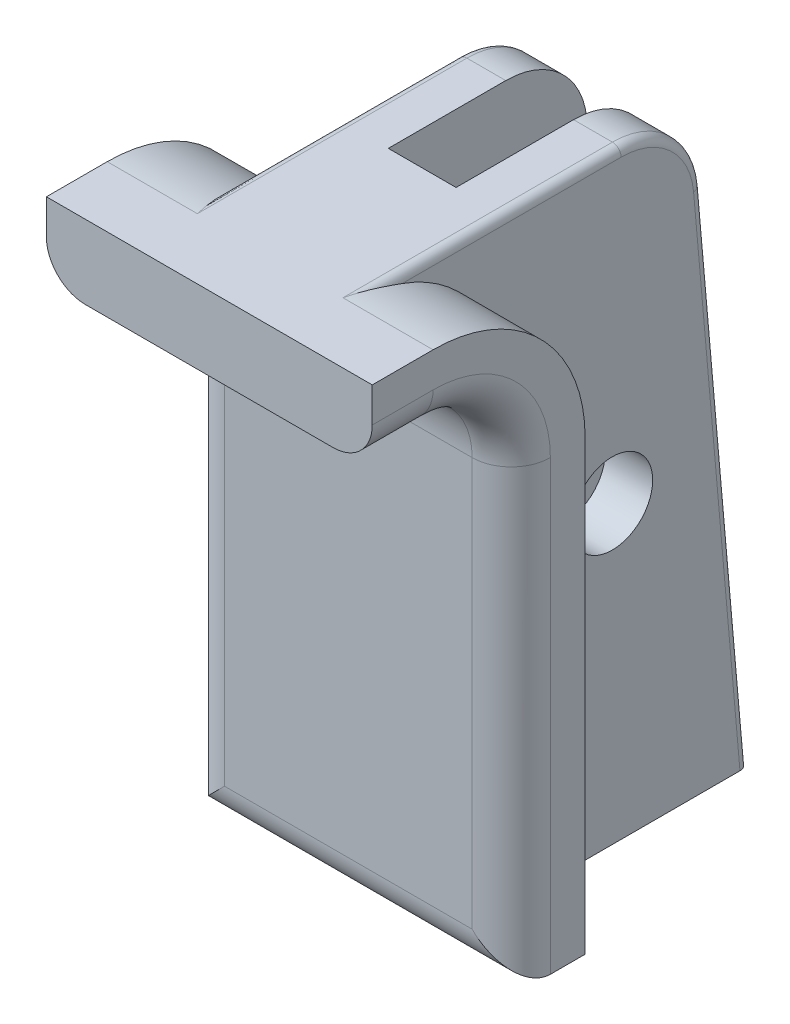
ISO-10303-21;
HEADER;
FILE_DESCRIPTION(('STEP AP214'),'2;1');
FILE_NAME('part.step','',(''),(''),'','','');
FILE_SCHEMA(('AUTOMOTIVE_DESIGN { 1 0 10303 214 1 1 1 1 }'));
ENDSEC;
DATA;
#1=APPLICATION_CONTEXT('core data for automotive mechanical design processes');
#2=APPLICATION_PROTOCOL_DEFINITION('international standard','automotive_design',2000,#1);
#3=PRODUCT_CONTEXT('',#1,'mechanical');
#4=PRODUCT('Part','Part','',(#3));
#5=PRODUCT_RELATED_PRODUCT_CATEGORY('part','',(#4));
#6=PRODUCT_DEFINITION_FORMATION('','',#4);
#7=PRODUCT_DEFINITION_CONTEXT('part definition',#1,'design');
#8=PRODUCT_DEFINITION('design','',#6,#7);
#9=PRODUCT_DEFINITION_SHAPE('','',#8);
#10=(LENGTH_UNIT() NAMED_UNIT(*) SI_UNIT(.MILLI.,.METRE.));
#11=(NAMED_UNIT(*) PLANE_ANGLE_UNIT() SI_UNIT($,.RADIAN.));
#12=(NAMED_UNIT(*) SI_UNIT($,.STERADIAN.) SOLID_ANGLE_UNIT());
#13=UNCERTAINTY_MEASURE_WITH_UNIT(LENGTH_MEASURE(1.E-05),#10,'distance_accuracy_value','');
#14=(GEOMETRIC_REPRESENTATION_CONTEXT(3) GLOBAL_UNCERTAINTY_ASSIGNED_CONTEXT((#13)) GLOBAL_UNIT_ASSIGNED_CONTEXT((#10,
#11,#12)) REPRESENTATION_CONTEXT('',''));
#15=CARTESIAN_POINT('',(0.,0.,0.));
#16=DIRECTION('',(0.,0.,1.));
#17=DIRECTION('',(1.,0.,0.));
#18=AXIS2_PLACEMENT_3D('',#15,#16,#17);
#19=CARTESIAN_POINT('',(2.38125,15.3544484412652,-5.80537774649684));
#20=DIRECTION('',(0.,-0.0880623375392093,0.99611496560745));
#21=DIRECTION('',(0.,-0.99611496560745,-0.0880623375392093));
#22=AXIS2_PLACEMENT_3D('',#19,#20,#21);
#23=PLANE('',#22);
#24=DIRECTION('',(-1.,0.,0.));
#25=VECTOR('',#24,1.);
#26=CARTESIAN_POINT('',(2.38125,15.3544484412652,-5.80537774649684));
#27=LINE('',#26,#25);
#28=CARTESIAN_POINT('',(-0.9906,15.3544484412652,-5.80537774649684));
#29=VERTEX_POINT('',#28);
#30=CARTESIAN_POINT('',(-2.12725,15.3544484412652,-5.80537774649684));
#31=VERTEX_POINT('',#30);
#32=EDGE_CURVE('E318',#29,#31,#27,.T.);
#33=ORIENTED_EDGE('',*,*,#32,.F.);
#34=DIRECTION('',(0.,-0.99611496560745,-0.0880623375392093));
#35=VECTOR('',#34,1.);
#36=CARTESIAN_POINT('',(-0.9906,15.3544484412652,-5.80537774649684));
#37=LINE('',#36,#35);
#38=CARTESIAN_POINT('',(-0.990600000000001,0.,-7.1628));
#39=VERTEX_POINT('',#38);
#40=EDGE_CURVE('E249',#29,#39,#37,.T.);
#41=ORIENTED_EDGE('',*,*,#40,.T.);
#42=DIRECTION('',(-1.,0.,0.));
#43=VECTOR('',#42,1.);
#44=CARTESIAN_POINT('',(2.38125,0.,-7.1628));
#45=LINE('',#44,#43);
#46=CARTESIAN_POINT('',(-2.12725,0.,-7.1628));
#47=VERTEX_POINT('',#46);
#48=EDGE_CURVE('E322',#39,#47,#45,.T.);
#49=ORIENTED_EDGE('',*,*,#48,.T.);
#50=DIRECTION('',(0.,0.99611496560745,0.0880623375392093));
#51=VECTOR('',#50,1.);
#52=CARTESIAN_POINT('',(-2.12725,15.3544484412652,-5.80537774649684));
#53=LINE('',#52,#51);
#54=EDGE_CURVE('E378',#47,#31,#53,.T.);
#55=ORIENTED_EDGE('',*,*,#54,.T.);
#56=EDGE_LOOP('',(#33,#41,#49,#55));
#57=FACE_BOUND('',#56,.T.);
#58=ADVANCED_FACE('F33',(#57),#23,.F.);
#59=CARTESIAN_POINT('',(2.38125,15.14475,-3.4333789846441));
#60=DIRECTION('',(-1.,0.,0.));
#61=DIRECTION('',(0.,0.,1.));
#62=AXIS2_PLACEMENT_3D('',#59,#60,#61);
#63=CYLINDRICAL_SURFACE('',#62,2.38125);
#64=DIRECTION('',(-1.,0.,0.));
#65=VECTOR('',#64,1.);
#66=CARTESIAN_POINT('',(2.38125,17.526,-3.4333789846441));
#67=LINE('',#66,#65);
#68=CARTESIAN_POINT('',(-0.9906,17.526,-3.4333789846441));
#69=VERTEX_POINT('',#68);
#70=CARTESIAN_POINT('',(-2.12725,17.526,-3.4333789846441));
#71=VERTEX_POINT('',#70);
#72=EDGE_CURVE('E310',#69,#71,#67,.T.);
#73=ORIENTED_EDGE('',*,*,#72,.F.);
#74=CARTESIAN_POINT('',(-0.9906,15.14475,-3.4333789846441));
#75=DIRECTION('',(-1.,0.,0.));
#76=DIRECTION('',(0.,0.,1.));
#77=AXIS2_PLACEMENT_3D('',#74,#75,#76);
#78=CIRCLE('',#77,2.38125);
#79=EDGE_CURVE('E227',#69,#29,#78,.T.);
#80=ORIENTED_EDGE('',*,*,#79,.T.);
#81=ORIENTED_EDGE('',*,*,#32,.T.);
#82=CARTESIAN_POINT('',(-2.12725,15.14475,-3.4333789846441));
#83=DIRECTION('',(1.,0.,0.));
#84=DIRECTION('',(0.,0.,-1.));
#85=AXIS2_PLACEMENT_3D('',#82,#83,#84);
#86=CIRCLE('',#85,2.38125);
#87=EDGE_CURVE('E394',#31,#71,#86,.T.);
#88=ORIENTED_EDGE('',*,*,#87,.T.);
#89=EDGE_LOOP('',(#73,#80,#81,#88));
#90=FACE_BOUND('',#89,.T.);
#91=ADVANCED_FACE('F453',(#90),#63,.T.);
#92=CARTESIAN_POINT('',(4.7625,13.081,4.445));
#93=DIRECTION('',(-1.,0.,0.));
#94=DIRECTION('',(0.,0.,1.));
#95=AXIS2_PLACEMENT_3D('',#92,#93,#94);
#96=CYLINDRICAL_SURFACE('',#95,4.445);
#97=CARTESIAN_POINT('',(-2.38125,13.081,4.445));
#98=DIRECTION('',(1.,0.,0.));
#99=DIRECTION('',(0.,0.,-1.));
#100=AXIS2_PLACEMENT_3D('',#97,#98,#99);
#101=CIRCLE('',#100,4.445);
#102=CARTESIAN_POINT('',(-2.38125,13.081,0.));
#103=VERTEX_POINT('',#102);
#104=CARTESIAN_POINT('',(-2.38125,17.272,2.96393821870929));
#105=VERTEX_POINT('',#104);
#106=EDGE_CURVE('E253',#103,#105,#101,.T.);
#107=ORIENTED_EDGE('',*,*,#106,.F.);
#108=DIRECTION('',(-1.,0.,0.));
#109=VECTOR('',#108,1.);
#110=CARTESIAN_POINT('',(4.7625,13.081,0.));
#111=LINE('',#110,#109);
#112=CARTESIAN_POINT('',(-4.7625,13.081,0.));
#113=VERTEX_POINT('',#112);
#114=EDGE_CURVE('E296',#103,#113,#111,.T.);
#115=ORIENTED_EDGE('',*,*,#114,.T.);
#116=CARTESIAN_POINT('',(-4.7625,13.081,4.445));
#117=DIRECTION('',(1.,0.,0.));
#118=DIRECTION('',(0.,0.,-1.));
#119=AXIS2_PLACEMENT_3D('',#116,#117,#118);
#120=CIRCLE('',#119,4.445);
#121=CARTESIAN_POINT('',(-4.7625,17.526,4.44500000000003));
#122=VERTEX_POINT('',#121);
#123=EDGE_CURVE('E277',#113,#122,#120,.T.);
#124=ORIENTED_EDGE('',*,*,#123,.T.);
#125=DIRECTION('',(-1.,0.,0.));
#126=VECTOR('',#125,1.);
#127=CARTESIAN_POINT('',(4.7625,17.526,4.44500000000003));
#128=LINE('',#127,#126);
#129=CARTESIAN_POINT('',(-2.12725,17.526,4.44500000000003));
#130=VERTEX_POINT('',#129);
#131=EDGE_CURVE('E58',#130,#122,#128,.T.);
#132=ORIENTED_EDGE('',*,*,#131,.F.);
#133=CARTESIAN_POINT('',(-2.38125,17.272,2.96393821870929));
#134=CARTESIAN_POINT('',(-2.38122661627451,17.2862236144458,3.00418337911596));
#135=CARTESIAN_POINT('',(-2.38005740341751,17.2998582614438,3.04461457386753));
#136=CARTESIAN_POINT('',(-2.37581660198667,17.3259225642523,3.12573211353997));
#137=CARTESIAN_POINT('',(-2.37274652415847,17.3383531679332,3.16641823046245));
#138=CARTESIAN_POINT('',(-2.36509781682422,17.3619870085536,3.24793093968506));
#139=CARTESIAN_POINT('',(-2.36052148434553,17.3731920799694,3.28875722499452));
#140=CARTESIAN_POINT('',(-2.35012615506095,17.3943998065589,3.3705728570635));
#141=CARTESIAN_POINT('',(-2.34430679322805,17.4044021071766,3.4115622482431));
#142=CARTESIAN_POINT('',(-2.32548742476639,17.4323736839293,3.53368855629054));
#143=CARTESIAN_POINT('',(-2.31101814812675,17.448602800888,3.61500541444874));
#144=CARTESIAN_POINT('',(-2.27944917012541,17.4764352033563,3.7779091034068));
#145=CARTESIAN_POINT('',(-2.26234854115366,17.4880368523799,3.85949601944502));
#146=CARTESIAN_POINT('',(-2.20858763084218,17.5159938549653,4.10457360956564));
#147=CARTESIAN_POINT('',(-2.16946634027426,17.5255037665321,4.26839214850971));
#148=CARTESIAN_POINT('',(-2.12931669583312,17.5259936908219,4.43635426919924));
#149=CARTESIAN_POINT('',(-2.12828331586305,17.5259999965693,4.44067720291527));
#150=CARTESIAN_POINT('',(-2.12725,17.526,4.445));
#151=B_SPLINE_CURVE_WITH_KNOTS('',3,(#133,#134,#135,#136,#137,#138,#139,#140,#141,#142,#143,
#144,#145,#146,#147,#148,#149,#150),.UNSPECIFIED.,.F.,.F.,(4,2,2,2,2,2,2,2,4),(0.,
0.128005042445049,0.255908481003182,0.383617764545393,0.511364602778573,0.763659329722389,
1.01604320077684,1.52077670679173,1.53411088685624),.UNSPECIFIED.);
#152=EDGE_CURVE('E408',#130,#105,#151,.F.);
#153=ORIENTED_EDGE('',*,*,#152,.T.);
#154=EDGE_LOOP('',(#107,#115,#124,#132,#153));
#155=FACE_BOUND('',#154,.T.);
#156=ADVANCED_FACE('F431',(#155),#96,.T.);
#157=CARTESIAN_POINT('',(2.38125,0.,0.));
#158=DIRECTION('',(0.,1.,0.));
#159=DIRECTION('',(0.,0.,1.));
#160=AXIS2_PLACEMENT_3D('',#157,#158,#159);
#161=PLANE('',#160);
#162=ORIENTED_EDGE('',*,*,#48,.F.);
#163=DIRECTION('',(0.,0.,-1.));
#164=VECTOR('',#163,1.);
#165=CARTESIAN_POINT('',(-0.990600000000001,0.,-10.4447005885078));
#166=LINE('',#165,#164);
#167=CARTESIAN_POINT('',(-0.990599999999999,0.,0.));
#168=VERTEX_POINT('',#167);
#169=EDGE_CURVE('E237',#168,#39,#166,.T.);
#170=ORIENTED_EDGE('',*,*,#169,.F.);
#171=DIRECTION('',(-1.,0.,0.));
#172=VECTOR('',#171,1.);
#173=CARTESIAN_POINT('',(0.9906,0.,0.));
#174=LINE('',#173,#172);
#175=CARTESIAN_POINT('',(0.9906,0.,0.));
#176=VERTEX_POINT('',#175);
#177=EDGE_CURVE('E217',#176,#168,#174,.T.);
#178=ORIENTED_EDGE('',*,*,#177,.F.);
#179=DIRECTION('',(0.,0.,1.));
#180=VECTOR('',#179,1.);
#181=CARTESIAN_POINT('',(0.990599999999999,0.,-10.4447005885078));
#182=LINE('',#181,#180);
#183=CARTESIAN_POINT('',(0.990599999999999,0.,-7.1628));
#184=VERTEX_POINT('',#183);
#185=EDGE_CURVE('E239',#184,#176,#182,.T.);
#186=ORIENTED_EDGE('',*,*,#185,.F.);
#187=CARTESIAN_POINT('',(2.12725,0.,-7.1628));
#188=VERTEX_POINT('',#187);
#189=EDGE_CURVE('E323',#188,#184,#45,.T.);
#190=ORIENTED_EDGE('',*,*,#189,.F.);
#191=CARTESIAN_POINT('',(2.12725,0.,-6.90780935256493));
#192=DIRECTION('',(0.,1.,0.));
#193=DIRECTION('',(0.,0.,-1.));
#194=AXIS2_PLACEMENT_3D('',#191,#192,#193);
#195=ELLIPSE('',#194,0.254990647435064,0.254);
#196=CARTESIAN_POINT('',(2.38125,0.,-6.90780935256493));
#197=VERTEX_POINT('',#196);
#198=EDGE_CURVE('E387',#188,#197,#195,.F.);
#199=ORIENTED_EDGE('',*,*,#198,.T.);
#200=DIRECTION('',(0.,0.,-1.));
#201=VECTOR('',#200,1.);
#202=CARTESIAN_POINT('',(2.38125,0.,0.));
#203=LINE('',#202,#201);
#204=CARTESIAN_POINT('',(2.38125,0.,0.));
#205=VERTEX_POINT('',#204);
#206=EDGE_CURVE('E307',#205,#197,#203,.T.);
#207=ORIENTED_EDGE('',*,*,#206,.F.);
#208=DIRECTION('',(-1.,0.,0.));
#209=VECTOR('',#208,1.);
#210=CARTESIAN_POINT('',(4.7625,0.,0.));
#211=LINE('',#210,#209);
#212=CARTESIAN_POINT('',(4.7625,0.,0.));
#213=VERTEX_POINT('',#212);
#214=EDGE_CURVE('E301',#213,#205,#211,.T.);
#215=ORIENTED_EDGE('',*,*,#214,.F.);
#216=DIRECTION('',(0.,0.,-1.));
#217=VECTOR('',#216,1.);
#218=CARTESIAN_POINT('',(4.7625,0.,2.159));
#219=LINE('',#218,#217);
#220=CARTESIAN_POINT('',(4.7625,0.,1.016));
#221=VERTEX_POINT('',#220);
#222=EDGE_CURVE('E260',#221,#213,#219,.T.);
#223=ORIENTED_EDGE('',*,*,#222,.F.);
#224=DIRECTION('',(-1.,0.,0.));
#225=VECTOR('',#224,1.);
#226=CARTESIAN_POINT('',(2.38125,0.,1.016));
#227=LINE('',#226,#225);
#228=CARTESIAN_POINT('',(-4.7625,0.,1.016));
#229=VERTEX_POINT('',#228);
#230=EDGE_CURVE('E357',#221,#229,#227,.T.);
#231=ORIENTED_EDGE('',*,*,#230,.T.);
#232=DIRECTION('',(0.,0.,-1.));
#233=VECTOR('',#232,1.);
#234=CARTESIAN_POINT('',(-4.7625,0.,2.159));
#235=LINE('',#234,#233);
#236=CARTESIAN_POINT('',(-4.7625,0.,0.));
#237=VERTEX_POINT('',#236);
#238=EDGE_CURVE('E259',#229,#237,#235,.T.);
#239=ORIENTED_EDGE('',*,*,#238,.T.);
#240=CARTESIAN_POINT('',(-2.38125,0.,0.));
#241=VERTEX_POINT('',#240);
#242=EDGE_CURVE('E300',#241,#237,#211,.T.);
#243=ORIENTED_EDGE('',*,*,#242,.F.);
#244=DIRECTION('',(0.,0.,-1.));
#245=VECTOR('',#244,1.);
#246=CARTESIAN_POINT('',(-2.38125,0.,0.));
#247=LINE('',#246,#245);
#248=CARTESIAN_POINT('',(-2.38125,0.,-6.90780935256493));
#249=VERTEX_POINT('',#248);
#250=EDGE_CURVE('E306',#241,#249,#247,.T.);
#251=ORIENTED_EDGE('',*,*,#250,.T.);
#252=CARTESIAN_POINT('',(-2.12725,0.,-6.90780935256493));
#253=DIRECTION('',(0.,1.,0.));
#254=DIRECTION('',(0.,0.,1.));
#255=AXIS2_PLACEMENT_3D('',#252,#253,#254);
#256=ELLIPSE('',#255,0.254990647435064,0.254);
#257=EDGE_CURVE('E389',#249,#47,#256,.F.);
#258=ORIENTED_EDGE('',*,*,#257,.T.);
#259=EDGE_LOOP('',(#162,#170,#178,#186,#190,#199,#207,#215,#223,#231,#239,#243,#251,#258));
#260=FACE_BOUND('',#259,.T.);
#261=ADVANCED_FACE('F456',(#260),#161,.F.);
#262=ORIENTED_EDGE('',*,*,#189,.T.);
#263=DIRECTION('',(0.,0.99611496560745,0.0880623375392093));
#264=VECTOR('',#263,1.);
#265=CARTESIAN_POINT('',(0.990599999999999,15.3544484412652,-5.80537774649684));
#266=LINE('',#265,#264);
#267=CARTESIAN_POINT('',(0.990599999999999,15.3544484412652,-5.80537774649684));
#268=VERTEX_POINT('',#267);
#269=EDGE_CURVE('E245',#184,#268,#266,.T.);
#270=ORIENTED_EDGE('',*,*,#269,.T.);
#271=CARTESIAN_POINT('',(2.12725,15.3544484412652,-5.80537774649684));
#272=VERTEX_POINT('',#271);
#273=EDGE_CURVE('E319',#272,#268,#27,.T.);
#274=ORIENTED_EDGE('',*,*,#273,.F.);
#275=DIRECTION('',(0.,0.99611496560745,0.0880623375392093));
#276=VECTOR('',#275,1.);
#277=CARTESIAN_POINT('',(2.12725,0.,-7.1628));
#278=LINE('',#277,#276);
#279=EDGE_CURVE('E359',#272,#188,#278,.F.);
#280=ORIENTED_EDGE('',*,*,#279,.T.);
#281=EDGE_LOOP('',(#262,#270,#274,#280));
#282=FACE_BOUND('',#281,.T.);
#283=ADVANCED_FACE('F451',(#282),#23,.F.);
#284=ORIENTED_EDGE('',*,*,#273,.T.);
#285=CARTESIAN_POINT('',(0.9906,15.14475,-3.4333789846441));
#286=DIRECTION('',(1.,0.,0.));
#287=DIRECTION('',(0.,0.,-1.));
#288=AXIS2_PLACEMENT_3D('',#285,#286,#287);
#289=CIRCLE('',#288,2.38125);
#290=CARTESIAN_POINT('',(0.9906,17.526,-3.4333789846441));
#291=VERTEX_POINT('',#290);
#292=EDGE_CURVE('E220',#268,#291,#289,.T.);
#293=ORIENTED_EDGE('',*,*,#292,.T.);
#294=CARTESIAN_POINT('',(2.12725,17.526,-3.4333789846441));
#295=VERTEX_POINT('',#294);
#296=EDGE_CURVE('E316',#295,#291,#67,.T.);
#297=ORIENTED_EDGE('',*,*,#296,.F.);
#298=CARTESIAN_POINT('',(2.12725,15.14475,-3.4333789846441));
#299=DIRECTION('',(1.,0.,0.));
#300=DIRECTION('',(0.,0.,-1.));
#301=AXIS2_PLACEMENT_3D('',#298,#299,#300);
#302=CIRCLE('',#301,2.38125);
#303=EDGE_CURVE('E392',#295,#272,#302,.F.);
#304=ORIENTED_EDGE('',*,*,#303,.T.);
#305=EDGE_LOOP('',(#284,#293,#297,#304));
#306=FACE_BOUND('',#305,.T.);
#307=ADVANCED_FACE('F448',(#306),#63,.T.);
#308=CARTESIAN_POINT('',(2.38125,17.526,-3.4333789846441));
#309=DIRECTION('',(0.,-1.,0.));
#310=DIRECTION('',(0.,0.,-1.));
#311=AXIS2_PLACEMENT_3D('',#308,#309,#310);
#312=PLANE('',#311);
#313=DIRECTION('',(-1.,0.,0.));
#314=VECTOR('',#313,1.);
#315=CARTESIAN_POINT('',(0.9906,17.526,0.));
#316=LINE('',#315,#314);
#317=CARTESIAN_POINT('',(0.9906,17.526,0.));
#318=VERTEX_POINT('',#317);
#319=CARTESIAN_POINT('',(-0.990599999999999,17.526,0.));
#320=VERTEX_POINT('',#319);
#321=EDGE_CURVE('E50',#318,#320,#316,.T.);
#322=ORIENTED_EDGE('',*,*,#321,.T.);
#323=DIRECTION('',(0.,0.,-1.));
#324=VECTOR('',#323,1.);
#325=CARTESIAN_POINT('',(-0.990600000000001,17.526,-10.4447005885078));
#326=LINE('',#325,#324);
#327=EDGE_CURVE('E224',#320,#69,#326,.T.);
#328=ORIENTED_EDGE('',*,*,#327,.T.);
#329=ORIENTED_EDGE('',*,*,#72,.T.);
#330=DIRECTION('',(0.,0.,1.));
#331=VECTOR('',#330,1.);
#332=CARTESIAN_POINT('',(-2.12725,17.526,-3.4333789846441));
#333=LINE('',#332,#331);
#334=EDGE_CURVE('E406',#71,#130,#333,.T.);
#335=ORIENTED_EDGE('',*,*,#334,.T.);
#336=ORIENTED_EDGE('',*,*,#131,.T.);
#337=DIRECTION('',(0.,0.,1.));
#338=VECTOR('',#337,1.);
#339=CARTESIAN_POINT('',(-4.7625,17.526,4.44500000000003));
#340=LINE('',#339,#338);
#341=CARTESIAN_POINT('',(-4.7625,17.526,6.223));
#342=VERTEX_POINT('',#341);
#343=EDGE_CURVE('E279',#122,#342,#340,.T.);
#344=ORIENTED_EDGE('',*,*,#343,.T.);
#345=DIRECTION('',(-1.,0.,0.));
#346=VECTOR('',#345,1.);
#347=CARTESIAN_POINT('',(4.7625,17.526,6.223));
#348=LINE('',#347,#346);
#349=CARTESIAN_POINT('',(4.7625,17.526,6.223));
#350=VERTEX_POINT('',#349);
#351=EDGE_CURVE('E291',#350,#342,#348,.T.);
#352=ORIENTED_EDGE('',*,*,#351,.F.);
#353=DIRECTION('',(0.,0.,1.));
#354=VECTOR('',#353,1.);
#355=CARTESIAN_POINT('',(4.7625,17.526,4.44500000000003));
#356=LINE('',#355,#354);
#357=CARTESIAN_POINT('',(4.7625,17.526,4.44500000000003));
#358=VERTEX_POINT('',#357);
#359=EDGE_CURVE('E267',#358,#350,#356,.T.);
#360=ORIENTED_EDGE('',*,*,#359,.F.);
#361=CARTESIAN_POINT('',(2.12725,17.526,4.44500000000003));
#362=VERTEX_POINT('',#361);
#363=EDGE_CURVE('E294',#358,#362,#128,.T.);
#364=ORIENTED_EDGE('',*,*,#363,.T.);
#365=DIRECTION('',(0.,0.,1.));
#366=VECTOR('',#365,1.);
#367=CARTESIAN_POINT('',(2.12725,17.526,-3.4333789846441));
#368=LINE('',#367,#366);
#369=EDGE_CURVE('E404',#362,#295,#368,.F.);
#370=ORIENTED_EDGE('',*,*,#369,.T.);
#371=ORIENTED_EDGE('',*,*,#296,.T.);
#372=DIRECTION('',(0.,0.,1.));
#373=VECTOR('',#372,1.);
#374=CARTESIAN_POINT('',(0.9906,17.526,-3.4333789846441));
#375=LINE('',#374,#373);
#376=EDGE_CURVE('E11',#291,#318,#375,.T.);
#377=ORIENTED_EDGE('',*,*,#376,.T.);
#378=EDGE_LOOP('',(#322,#328,#329,#335,#336,#344,#352,#360,#364,#370,#371,#377));
#379=FACE_BOUND('',#378,.T.);
#380=ADVANCED_FACE('F231',(#379),#312,.F.);
#381=CARTESIAN_POINT('',(2.38125,15.14475,-3.4333789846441));
#382=DIRECTION('',(1.,0.,0.));
#383=DIRECTION('',(0.,0.,-1.));
#384=AXIS2_PLACEMENT_3D('',#381,#382,#383);
#385=PLANE('',#384);
#386=CARTESIAN_POINT('',(2.38125,8.636,-3.175));
#387=DIRECTION('',(1.,0.,0.));
#388=DIRECTION('',(0.,0.,-1.));
#389=AXIS2_PLACEMENT_3D('',#386,#387,#388);
#390=CIRCLE('',#389,1.1811);
#391=CARTESIAN_POINT('',(2.38125,8.636,-4.3561));
#392=VERTEX_POINT('',#391);
#393=EDGE_CURVE('E837',#392,#392,#390,.T.);
#394=ORIENTED_EDGE('',*,*,#393,.F.);
#395=EDGE_LOOP('',(#394));
#396=FACE_BOUND('',#395,.T.);
#397=ORIENTED_EDGE('',*,*,#206,.T.);
#398=DIRECTION('',(0.,0.99611496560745,0.0880623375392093));
#399=VECTOR('',#398,1.);
#400=CARTESIAN_POINT('',(2.38125,15.3320806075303,-5.55236454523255));
#401=LINE('',#400,#399);
#402=CARTESIAN_POINT('',(2.38125,15.3320806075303,-5.55236454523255));
#403=VERTEX_POINT('',#402);
#404=EDGE_CURVE('E401',#197,#403,#401,.T.);
#405=ORIENTED_EDGE('',*,*,#404,.T.);
#406=CARTESIAN_POINT('',(2.38125,15.14475,-3.4333789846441));
#407=DIRECTION('',(1.,0.,0.));
#408=DIRECTION('',(0.,0.,-1.));
#409=AXIS2_PLACEMENT_3D('',#406,#407,#408);
#410=CIRCLE('',#409,2.12725);
#411=CARTESIAN_POINT('',(2.38125,17.272,-3.4333789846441));
#412=VERTEX_POINT('',#411);
#413=EDGE_CURVE('E399',#403,#412,#410,.T.);
#414=ORIENTED_EDGE('',*,*,#413,.T.);
#415=DIRECTION('',(0.,0.,1.));
#416=VECTOR('',#415,1.);
#417=CARTESIAN_POINT('',(2.38125,17.272,4.44500000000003));
#418=LINE('',#417,#416);
#419=CARTESIAN_POINT('',(2.38125,17.272,2.96393821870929));
#420=VERTEX_POINT('',#419);
#421=EDGE_CURVE('E397',#412,#420,#418,.T.);
#422=ORIENTED_EDGE('',*,*,#421,.T.);
#423=CARTESIAN_POINT('',(2.38125,13.081,4.445));
#424=DIRECTION('',(1.,0.,0.));
#425=DIRECTION('',(0.,0.,-1.));
#426=AXIS2_PLACEMENT_3D('',#423,#424,#425);
#427=CIRCLE('',#426,4.445);
#428=CARTESIAN_POINT('',(2.38125,13.081,0.));
#429=VERTEX_POINT('',#428);
#430=EDGE_CURVE('E256',#420,#429,#427,.F.);
#431=ORIENTED_EDGE('',*,*,#430,.T.);
#432=DIRECTION('',(0.,-1.,0.));
#433=VECTOR('',#432,1.);
#434=CARTESIAN_POINT('',(2.38125,15.14475,0.));
#435=LINE('',#434,#433);
#436=EDGE_CURVE('E304',#429,#205,#435,.T.);
#437=ORIENTED_EDGE('',*,*,#436,.T.);
#438=EDGE_LOOP('',(#397,#405,#414,#422,#431,#437));
#439=FACE_BOUND('',#438,.T.);
#440=ADVANCED_FACE('F438',(#396,#439),#385,.T.);
#441=CARTESIAN_POINT('',(-2.38125,15.14475,-3.4333789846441));
#442=DIRECTION('',(1.,0.,0.));
#443=DIRECTION('',(0.,0.,-1.));
#444=AXIS2_PLACEMENT_3D('',#441,#442,#443);
#445=PLANE('',#444);
#446=CARTESIAN_POINT('',(-2.38125,8.636,-3.175));
#447=DIRECTION('',(1.,0.,0.));
#448=DIRECTION('',(0.,0.,-1.));
#449=AXIS2_PLACEMENT_3D('',#446,#447,#448);
#450=CIRCLE('',#449,1.1811);
#451=CARTESIAN_POINT('',(-2.38125,8.636,-4.3561));
#452=VERTEX_POINT('',#451);
#453=EDGE_CURVE('E240',#452,#452,#450,.T.);
#454=ORIENTED_EDGE('',*,*,#453,.T.);
#455=EDGE_LOOP('',(#454));
#456=FACE_BOUND('',#455,.T.);
#457=CARTESIAN_POINT('',(-2.38125,15.14475,-3.4333789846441));
#458=DIRECTION('',(1.,0.,0.));
#459=DIRECTION('',(0.,0.,-1.));
#460=AXIS2_PLACEMENT_3D('',#457,#458,#459);
#461=CIRCLE('',#460,2.12725);
#462=CARTESIAN_POINT('',(-2.38125,17.272,-3.4333789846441));
#463=VERTEX_POINT('',#462);
#464=CARTESIAN_POINT('',(-2.38125,15.3320806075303,-5.55236454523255));
#465=VERTEX_POINT('',#464);
#466=EDGE_CURVE('E383',#463,#465,#461,.F.);
#467=ORIENTED_EDGE('',*,*,#466,.T.);
#468=DIRECTION('',(0.,0.99611496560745,0.0880623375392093));
#469=VECTOR('',#468,1.);
#470=CARTESIAN_POINT('',(-2.38125,15.3320806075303,-5.55236454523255));
#471=LINE('',#470,#469);
#472=EDGE_CURVE('E385',#465,#249,#471,.F.);
#473=ORIENTED_EDGE('',*,*,#472,.T.);
#474=ORIENTED_EDGE('',*,*,#250,.F.);
#475=DIRECTION('',(0.,-1.,0.));
#476=VECTOR('',#475,1.);
#477=CARTESIAN_POINT('',(-2.38125,0.,0.));
#478=LINE('',#477,#476);
#479=EDGE_CURVE('E311',#103,#241,#478,.T.);
#480=ORIENTED_EDGE('',*,*,#479,.F.);
#481=ORIENTED_EDGE('',*,*,#106,.T.);
#482=DIRECTION('',(0.,0.,1.));
#483=VECTOR('',#482,1.);
#484=CARTESIAN_POINT('',(-2.38125,17.272,-3.4333789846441));
#485=LINE('',#484,#483);
#486=EDGE_CURVE('E381',#105,#463,#485,.F.);
#487=ORIENTED_EDGE('',*,*,#486,.T.);
#488=EDGE_LOOP('',(#467,#473,#474,#480,#481,#487));
#489=FACE_BOUND('',#488,.T.);
#490=ADVANCED_FACE('F441',(#456,#489),#445,.F.);
#491=CARTESIAN_POINT('',(4.7625,13.081,0.));
#492=DIRECTION('',(0.,0.,1.));
#493=DIRECTION('',(1.,0.,0.));
#494=AXIS2_PLACEMENT_3D('',#491,#492,#493);
#495=PLANE('',#494);
#496=ORIENTED_EDGE('',*,*,#114,.F.);
#497=ORIENTED_EDGE('',*,*,#479,.T.);
#498=ORIENTED_EDGE('',*,*,#242,.T.);
#499=DIRECTION('',(0.,1.,0.));
#500=VECTOR('',#499,1.);
#501=CARTESIAN_POINT('',(-4.7625,13.081,0.));
#502=LINE('',#501,#500);
#503=EDGE_CURVE('E274',#237,#113,#502,.T.);
#504=ORIENTED_EDGE('',*,*,#503,.T.);
#505=EDGE_LOOP('',(#496,#497,#498,#504));
#506=FACE_BOUND('',#505,.T.);
#507=ADVANCED_FACE('F436',(#506),#495,.F.);
#508=ORIENTED_EDGE('',*,*,#436,.F.);
#509=CARTESIAN_POINT('',(4.7625,13.081,0.));
#510=VERTEX_POINT('',#509);
#511=EDGE_CURVE('E297',#510,#429,#111,.T.);
#512=ORIENTED_EDGE('',*,*,#511,.F.);
#513=DIRECTION('',(0.,1.,0.));
#514=VECTOR('',#513,1.);
#515=CARTESIAN_POINT('',(4.7625,13.081,0.));
#516=LINE('',#515,#514);
#517=EDGE_CURVE('E262',#213,#510,#516,.T.);
#518=ORIENTED_EDGE('',*,*,#517,.F.);
#519=ORIENTED_EDGE('',*,*,#214,.T.);
#520=EDGE_LOOP('',(#508,#512,#518,#519));
#521=FACE_BOUND('',#520,.T.);
#522=ADVANCED_FACE('F429',(#521),#495,.F.);
#523=ORIENTED_EDGE('',*,*,#511,.T.);
#524=ORIENTED_EDGE('',*,*,#430,.F.);
#525=CARTESIAN_POINT('',(2.38125,17.272,2.96393821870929));
#526=CARTESIAN_POINT('',(2.38122661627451,17.2862236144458,3.00418337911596));
#527=CARTESIAN_POINT('',(2.38005740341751,17.2998582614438,3.04461457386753));
#528=CARTESIAN_POINT('',(2.37581660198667,17.3259225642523,3.12573211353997));
#529=CARTESIAN_POINT('',(2.37274652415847,17.3383531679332,3.16641823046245));
#530=CARTESIAN_POINT('',(2.36509781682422,17.3619870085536,3.24793093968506));
#531=CARTESIAN_POINT('',(2.36052148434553,17.3731920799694,3.28875722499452));
#532=CARTESIAN_POINT('',(2.35012615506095,17.3943998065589,3.3705728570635));
#533=CARTESIAN_POINT('',(2.34430679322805,17.4044021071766,3.4115622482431));
#534=CARTESIAN_POINT('',(2.32548742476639,17.4323736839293,3.53368855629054));
#535=CARTESIAN_POINT('',(2.31101814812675,17.448602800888,3.61500541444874));
#536=CARTESIAN_POINT('',(2.27944917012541,17.4764352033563,3.7779091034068));
#537=CARTESIAN_POINT('',(2.26234854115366,17.4880368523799,3.85949601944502));
#538=CARTESIAN_POINT('',(2.20858763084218,17.5159938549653,4.10457360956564));
#539=CARTESIAN_POINT('',(2.16946634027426,17.5255037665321,4.26839214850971));
#540=CARTESIAN_POINT('',(2.12931669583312,17.5259936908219,4.43635426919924));
#541=CARTESIAN_POINT('',(2.12828331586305,17.5259999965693,4.44067720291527));
#542=CARTESIAN_POINT('',(2.12725,17.526,4.445));
#543=B_SPLINE_CURVE_WITH_KNOTS('',3,(#525,#526,#527,#528,#529,#530,#531,#532,#533,#534,#535,
#536,#537,#538,#539,#540,#541,#542),.UNSPECIFIED.,.F.,.F.,(4,2,2,2,2,2,2,2,4),(0.,
0.128005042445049,0.255908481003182,0.383617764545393,0.511364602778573,0.763659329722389,
1.01604320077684,1.52077670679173,1.53411088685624),.UNSPECIFIED.);
#544=EDGE_CURVE('E43',#420,#362,#543,.T.);
#545=ORIENTED_EDGE('',*,*,#544,.T.);
#546=ORIENTED_EDGE('',*,*,#363,.F.);
#547=CARTESIAN_POINT('',(4.7625,13.081,4.445));
#548=DIRECTION('',(1.,0.,0.));
#549=DIRECTION('',(0.,0.,-1.));
#550=AXIS2_PLACEMENT_3D('',#547,#548,#549);
#551=CIRCLE('',#550,4.445);
#552=EDGE_CURVE('E265',#510,#358,#551,.T.);
#553=ORIENTED_EDGE('',*,*,#552,.F.);
#554=EDGE_LOOP('',(#523,#524,#545,#546,#553));
#555=FACE_BOUND('',#554,.T.);
#556=ADVANCED_FACE('F423',(#555),#96,.T.);
#557=CARTESIAN_POINT('',(4.7625,17.526,6.223));
#558=DIRECTION('',(0.,0.,-1.));
#559=DIRECTION('',(-1.,0.,0.));
#560=AXIS2_PLACEMENT_3D('',#557,#558,#559);
#561=PLANE('',#560);
#562=DIRECTION('',(-1.,0.,0.));
#563=VECTOR('',#562,1.);
#564=CARTESIAN_POINT('',(4.7625,15.367,6.223));
#565=LINE('',#564,#563);
#566=CARTESIAN_POINT('',(3.6195,15.367,6.223));
#567=VERTEX_POINT('',#566);
#568=CARTESIAN_POINT('',(-3.6195,15.367,6.223));
#569=VERTEX_POINT('',#568);
#570=EDGE_CURVE('E288',#567,#569,#565,.T.);
#571=ORIENTED_EDGE('',*,*,#570,.F.);
#572=CARTESIAN_POINT('',(3.6195,16.51,6.223));
#573=DIRECTION('',(0.,0.,-1.));
#574=DIRECTION('',(-1.,0.,0.));
#575=AXIS2_PLACEMENT_3D('',#572,#573,#574);
#576=CIRCLE('',#575,1.143);
#577=CARTESIAN_POINT('',(4.7625,16.51,6.223));
#578=VERTEX_POINT('',#577);
#579=EDGE_CURVE('E339',#567,#578,#576,.F.);
#580=ORIENTED_EDGE('',*,*,#579,.T.);
#581=DIRECTION('',(0.,-1.,0.));
#582=VECTOR('',#581,1.);
#583=CARTESIAN_POINT('',(4.7625,17.526,6.223));
#584=LINE('',#583,#582);
#585=EDGE_CURVE('E269',#350,#578,#584,.T.);
#586=ORIENTED_EDGE('',*,*,#585,.F.);
#587=ORIENTED_EDGE('',*,*,#351,.T.);
#588=DIRECTION('',(0.,-1.,0.));
#589=VECTOR('',#588,1.);
#590=CARTESIAN_POINT('',(-4.7625,17.526,6.223));
#591=LINE('',#590,#589);
#592=CARTESIAN_POINT('',(-4.7625,16.51,6.223));
#593=VERTEX_POINT('',#592);
#594=EDGE_CURVE('E263',#342,#593,#591,.T.);
#595=ORIENTED_EDGE('',*,*,#594,.T.);
#596=CARTESIAN_POINT('',(-3.6195,16.51,6.223));
#597=DIRECTION('',(0.,0.,-1.));
#598=DIRECTION('',(-1.,0.,0.));
#599=AXIS2_PLACEMENT_3D('',#596,#597,#598);
#600=CIRCLE('',#599,1.143);
#601=EDGE_CURVE('E337',#593,#569,#600,.F.);
#602=ORIENTED_EDGE('',*,*,#601,.T.);
#603=EDGE_LOOP('',(#571,#580,#586,#587,#595,#602));
#604=FACE_BOUND('',#603,.T.);
#605=ADVANCED_FACE('F428',(#604),#561,.F.);
#606=CARTESIAN_POINT('',(4.7625,15.367,4.44500000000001));
#607=DIRECTION('',(0.,1.,0.));
#608=DIRECTION('',(0.,0.,1.));
#609=AXIS2_PLACEMENT_3D('',#606,#607,#608);
#610=PLANE('',#609);
#611=DIRECTION('',(-1.,0.,0.));
#612=VECTOR('',#611,1.);
#613=CARTESIAN_POINT('',(4.7625,15.367,4.44500000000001));
#614=LINE('',#613,#612);
#615=CARTESIAN_POINT('',(3.6195,15.367,4.44500000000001));
#616=VERTEX_POINT('',#615);
#617=CARTESIAN_POINT('',(-3.6195,15.367,4.44500000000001));
#618=VERTEX_POINT('',#617);
#619=EDGE_CURVE('E285',#616,#618,#614,.T.);
#620=ORIENTED_EDGE('',*,*,#619,.F.);
#621=DIRECTION('',(0.,0.,-1.));
#622=VECTOR('',#621,1.);
#623=CARTESIAN_POINT('',(3.6195,15.367,6.223));
#624=LINE('',#623,#622);
#625=EDGE_CURVE('E335',#616,#567,#624,.F.);
#626=ORIENTED_EDGE('',*,*,#625,.T.);
#627=ORIENTED_EDGE('',*,*,#570,.T.);
#628=DIRECTION('',(0.,0.,-1.));
#629=VECTOR('',#628,1.);
#630=CARTESIAN_POINT('',(-3.6195,15.367,4.44500000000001));
#631=LINE('',#630,#629);
#632=EDGE_CURVE('E333',#569,#618,#631,.T.);
#633=ORIENTED_EDGE('',*,*,#632,.T.);
#634=EDGE_LOOP('',(#620,#626,#627,#633));
#635=FACE_BOUND('',#634,.T.);
#636=ADVANCED_FACE('F615',(#635),#610,.F.);
#637=CARTESIAN_POINT('',(4.7625,13.081,4.445));
#638=DIRECTION('',(-1.,0.,0.));
#639=DIRECTION('',(0.,0.,1.));
#640=AXIS2_PLACEMENT_3D('',#637,#638,#639);
#641=CYLINDRICAL_SURFACE('',#640,2.286);
#642=DIRECTION('',(-1.,0.,0.));
#643=VECTOR('',#642,1.);
#644=CARTESIAN_POINT('',(4.7625,13.081,2.159));
#645=LINE('',#644,#643);
#646=CARTESIAN_POINT('',(3.6195,13.081,2.159));
#647=VERTEX_POINT('',#646);
#648=CARTESIAN_POINT('',(-3.6195,13.081,2.159));
#649=VERTEX_POINT('',#648);
#650=EDGE_CURVE('E272',#647,#649,#645,.T.);
#651=ORIENTED_EDGE('',*,*,#650,.F.);
#652=CARTESIAN_POINT('',(3.6195,13.081,4.445));
#653=DIRECTION('',(1.,0.,0.));
#654=DIRECTION('',(0.,0.,-1.));
#655=AXIS2_PLACEMENT_3D('',#652,#653,#654);
#656=CIRCLE('',#655,2.286);
#657=EDGE_CURVE('E343',#647,#616,#656,.T.);
#658=ORIENTED_EDGE('',*,*,#657,.T.);
#659=ORIENTED_EDGE('',*,*,#619,.T.);
#660=CARTESIAN_POINT('',(-3.6195,13.081,4.445));
#661=DIRECTION('',(1.,0.,0.));
#662=DIRECTION('',(0.,0.,-1.));
#663=AXIS2_PLACEMENT_3D('',#660,#661,#662);
#664=CIRCLE('',#663,2.286);
#665=EDGE_CURVE('E341',#618,#649,#664,.F.);
#666=ORIENTED_EDGE('',*,*,#665,.T.);
#667=EDGE_LOOP('',(#651,#658,#659,#666));
#668=FACE_BOUND('',#667,.T.);
#669=ADVANCED_FACE('F575',(#668),#641,.F.);
#670=CARTESIAN_POINT('',(4.7625,13.081,2.159));
#671=DIRECTION('',(0.,0.,-1.));
#672=DIRECTION('',(0.,1.,0.));
#673=AXIS2_PLACEMENT_3D('',#670,#671,#672);
#674=PLANE('',#673);
#675=DIRECTION('',(-1.,0.,0.));
#676=VECTOR('',#675,1.);
#677=CARTESIAN_POINT('',(4.7625,1.143,2.159));
#678=LINE('',#677,#676);
#679=CARTESIAN_POINT('',(-3.6195,1.143,2.159));
#680=VERTEX_POINT('',#679);
#681=CARTESIAN_POINT('',(3.6195,1.143,2.159));
#682=VERTEX_POINT('',#681);
#683=EDGE_CURVE('E353',#680,#682,#678,.F.);
#684=ORIENTED_EDGE('',*,*,#683,.T.);
#685=DIRECTION('',(0.,-1.,0.));
#686=VECTOR('',#685,1.);
#687=CARTESIAN_POINT('',(3.6195,13.081,2.159));
#688=LINE('',#687,#686);
#689=EDGE_CURVE('E355',#682,#647,#688,.F.);
#690=ORIENTED_EDGE('',*,*,#689,.T.);
#691=ORIENTED_EDGE('',*,*,#650,.T.);
#692=DIRECTION('',(0.,-1.,0.));
#693=VECTOR('',#692,1.);
#694=CARTESIAN_POINT('',(-3.6195,13.081,2.159));
#695=LINE('',#694,#693);
#696=EDGE_CURVE('E351',#649,#680,#695,.T.);
#697=ORIENTED_EDGE('',*,*,#696,.T.);
#698=EDGE_LOOP('',(#684,#690,#691,#697));
#699=FACE_BOUND('',#698,.T.);
#700=ADVANCED_FACE('F572',(#699),#674,.F.);
#701=CARTESIAN_POINT('',(4.7625,13.081,4.445));
#702=DIRECTION('',(1.,0.,0.));
#703=DIRECTION('',(0.,0.,-1.));
#704=AXIS2_PLACEMENT_3D('',#701,#702,#703);
#705=PLANE('',#704);
#706=ORIENTED_EDGE('',*,*,#585,.T.);
#707=DIRECTION('',(0.,0.,-1.));
#708=VECTOR('',#707,1.);
#709=CARTESIAN_POINT('',(4.7625,16.51,4.44500000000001));
#710=LINE('',#709,#708);
#711=CARTESIAN_POINT('',(4.7625,16.51,4.44500000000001));
#712=VERTEX_POINT('',#711);
#713=EDGE_CURVE('E330',#578,#712,#710,.T.);
#714=ORIENTED_EDGE('',*,*,#713,.T.);
#715=CARTESIAN_POINT('',(4.7625,13.081,4.445));
#716=DIRECTION('',(1.,0.,0.));
#717=DIRECTION('',(0.,0.,-1.));
#718=AXIS2_PLACEMENT_3D('',#715,#716,#717);
#719=CIRCLE('',#718,3.429);
#720=CARTESIAN_POINT('',(4.7625,13.081,1.016));
#721=VERTEX_POINT('',#720);
#722=EDGE_CURVE('E328',#712,#721,#719,.F.);
#723=ORIENTED_EDGE('',*,*,#722,.T.);
#724=DIRECTION('',(0.,-1.,0.));
#725=VECTOR('',#724,1.);
#726=CARTESIAN_POINT('',(4.7625,0.,1.016));
#727=LINE('',#726,#725);
#728=EDGE_CURVE('E326',#721,#221,#727,.T.);
#729=ORIENTED_EDGE('',*,*,#728,.T.);
#730=ORIENTED_EDGE('',*,*,#222,.T.);
#731=ORIENTED_EDGE('',*,*,#517,.T.);
#732=ORIENTED_EDGE('',*,*,#552,.T.);
#733=ORIENTED_EDGE('',*,*,#359,.T.);
#734=EDGE_LOOP('',(#706,#714,#723,#729,#730,#731,#732,#733));
#735=FACE_BOUND('',#734,.T.);
#736=ADVANCED_FACE('F559',(#735),#705,.T.);
#737=CARTESIAN_POINT('',(-4.7625,13.081,4.445));
#738=DIRECTION('',(1.,0.,0.));
#739=DIRECTION('',(0.,0.,-1.));
#740=AXIS2_PLACEMENT_3D('',#737,#738,#739);
#741=PLANE('',#740);
#742=CARTESIAN_POINT('',(-4.7625,13.081,4.445));
#743=DIRECTION('',(1.,0.,0.));
#744=DIRECTION('',(0.,0.,-1.));
#745=AXIS2_PLACEMENT_3D('',#742,#743,#744);
#746=CIRCLE('',#745,3.429);
#747=CARTESIAN_POINT('',(-4.7625,13.081,1.016));
#748=VERTEX_POINT('',#747);
#749=CARTESIAN_POINT('',(-4.7625,16.51,4.44500000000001));
#750=VERTEX_POINT('',#749);
#751=EDGE_CURVE('E347',#748,#750,#746,.T.);
#752=ORIENTED_EDGE('',*,*,#751,.T.);
#753=DIRECTION('',(0.,0.,-1.));
#754=VECTOR('',#753,1.);
#755=CARTESIAN_POINT('',(-4.7625,16.51,4.445));
#756=LINE('',#755,#754);
#757=EDGE_CURVE('E349',#750,#593,#756,.F.);
#758=ORIENTED_EDGE('',*,*,#757,.T.);
#759=ORIENTED_EDGE('',*,*,#594,.F.);
#760=ORIENTED_EDGE('',*,*,#343,.F.);
#761=ORIENTED_EDGE('',*,*,#123,.F.);
#762=ORIENTED_EDGE('',*,*,#503,.F.);
#763=ORIENTED_EDGE('',*,*,#238,.F.);
#764=DIRECTION('',(0.,-1.,0.));
#765=VECTOR('',#764,1.);
#766=CARTESIAN_POINT('',(-4.7625,13.081,1.016));
#767=LINE('',#766,#765);
#768=EDGE_CURVE('E345',#229,#748,#767,.F.);
#769=ORIENTED_EDGE('',*,*,#768,.T.);
#770=EDGE_LOOP('',(#752,#758,#759,#760,#761,#762,#763,#769));
#771=FACE_BOUND('',#770,.T.);
#772=ADVANCED_FACE('F488',(#771),#741,.F.);
#773=CARTESIAN_POINT('',(-3.6195,16.51,4.44500000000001));
#774=DIRECTION('',(0.,0.,-1.));
#775=DIRECTION('',(-1.,0.,0.));
#776=AXIS2_PLACEMENT_3D('',#773,#774,#775);
#777=CYLINDRICAL_SURFACE('',#776,1.143);
#778=ORIENTED_EDGE('',*,*,#601,.F.);
#779=ORIENTED_EDGE('',*,*,#757,.F.);
#780=CARTESIAN_POINT('',(-3.6195,16.51,4.44500000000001));
#781=DIRECTION('',(0.,0.,-1.));
#782=DIRECTION('',(-1.,0.,0.));
#783=AXIS2_PLACEMENT_3D('',#780,#781,#782);
#784=CIRCLE('',#783,1.143);
#785=EDGE_CURVE('E257',#618,#750,#784,.T.);
#786=ORIENTED_EDGE('',*,*,#785,.F.);
#787=ORIENTED_EDGE('',*,*,#632,.F.);
#788=EDGE_LOOP('',(#778,#779,#786,#787));
#789=FACE_BOUND('',#788,.T.);
#790=ADVANCED_FACE('F484',(#789),#777,.T.);
#791=CARTESIAN_POINT('',(-3.6195,13.081,4.445));
#792=DIRECTION('',(1.,0.,0.));
#793=DIRECTION('',(0.,0.,-1.));
#794=AXIS2_PLACEMENT_3D('',#791,#792,#793);
#795=TOROIDAL_SURFACE('',#794,3.429,1.143);
#796=ORIENTED_EDGE('',*,*,#785,.T.);
#797=ORIENTED_EDGE('',*,*,#751,.F.);
#798=CARTESIAN_POINT('',(-3.6195,13.081,1.016));
#799=DIRECTION('',(0.,-1.,0.));
#800=DIRECTION('',(0.,0.,-1.));
#801=AXIS2_PLACEMENT_3D('',#798,#799,#800);
#802=CIRCLE('',#801,1.143);
#803=EDGE_CURVE('E372',#649,#748,#802,.T.);
#804=ORIENTED_EDGE('',*,*,#803,.F.);
#805=ORIENTED_EDGE('',*,*,#665,.F.);
#806=EDGE_LOOP('',(#796,#797,#804,#805));
#807=FACE_BOUND('',#806,.T.);
#808=ADVANCED_FACE('F480',(#807),#795,.T.);
#809=CARTESIAN_POINT('',(-3.6195,13.081,1.016));
#810=DIRECTION('',(0.,-1.,0.));
#811=DIRECTION('',(0.,0.,-1.));
#812=AXIS2_PLACEMENT_3D('',#809,#810,#811);
#813=CYLINDRICAL_SURFACE('',#812,1.143);
#814=ORIENTED_EDGE('',*,*,#803,.T.);
#815=ORIENTED_EDGE('',*,*,#768,.F.);
#816=CARTESIAN_POINT('',(-3.6195,1.143,1.016));
#817=DIRECTION('',(0.707106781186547,-0.707106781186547,0.));
#818=DIRECTION('',(-0.707106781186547,-0.707106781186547,0.));
#819=AXIS2_PLACEMENT_3D('',#816,#817,#818);
#820=ELLIPSE('',#819,1.61644610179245,1.143);
#821=EDGE_CURVE('E369',#680,#229,#820,.T.);
#822=ORIENTED_EDGE('',*,*,#821,.F.);
#823=ORIENTED_EDGE('',*,*,#696,.F.);
#824=EDGE_LOOP('',(#814,#815,#822,#823));
#825=FACE_BOUND('',#824,.T.);
#826=ADVANCED_FACE('F476',(#825),#813,.T.);
#827=CARTESIAN_POINT('',(2.38125,1.143,1.016));
#828=DIRECTION('',(-1.,0.,0.));
#829=DIRECTION('',(0.,0.,1.));
#830=AXIS2_PLACEMENT_3D('',#827,#828,#829);
#831=CYLINDRICAL_SURFACE('',#830,1.143);
#832=ORIENTED_EDGE('',*,*,#821,.T.);
#833=ORIENTED_EDGE('',*,*,#230,.F.);
#834=CARTESIAN_POINT('',(3.6195,1.143,1.016));
#835=DIRECTION('',(-0.707106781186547,-0.707106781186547,0.));
#836=DIRECTION('',(-0.707106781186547,0.707106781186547,0.));
#837=AXIS2_PLACEMENT_3D('',#834,#835,#836);
#838=ELLIPSE('',#837,1.61644610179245,1.143);
#839=EDGE_CURVE('E366',#682,#221,#838,.F.);
#840=ORIENTED_EDGE('',*,*,#839,.F.);
#841=ORIENTED_EDGE('',*,*,#683,.F.);
#842=EDGE_LOOP('',(#832,#833,#840,#841));
#843=FACE_BOUND('',#842,.T.);
#844=ADVANCED_FACE('F472',(#843),#831,.T.);
#845=CARTESIAN_POINT('',(3.6195,13.081,1.016));
#846=DIRECTION('',(0.,1.,0.));
#847=DIRECTION('',(0.,0.,1.));
#848=AXIS2_PLACEMENT_3D('',#845,#846,#847);
#849=CYLINDRICAL_SURFACE('',#848,1.143);
#850=ORIENTED_EDGE('',*,*,#839,.T.);
#851=ORIENTED_EDGE('',*,*,#728,.F.);
#852=CARTESIAN_POINT('',(3.6195,13.081,1.016));
#853=DIRECTION('',(0.,1.,0.));
#854=DIRECTION('',(-1.,0.,0.));
#855=AXIS2_PLACEMENT_3D('',#852,#853,#854);
#856=CIRCLE('',#855,1.143);
#857=EDGE_CURVE('E362',#647,#721,#856,.T.);
#858=ORIENTED_EDGE('',*,*,#857,.F.);
#859=ORIENTED_EDGE('',*,*,#689,.F.);
#860=EDGE_LOOP('',(#850,#851,#858,#859));
#861=FACE_BOUND('',#860,.T.);
#862=ADVANCED_FACE('F468',(#861),#849,.T.);
#863=CARTESIAN_POINT('',(3.6195,13.081,4.445));
#864=DIRECTION('',(1.,0.,0.));
#865=DIRECTION('',(0.,0.,-1.));
#866=AXIS2_PLACEMENT_3D('',#863,#864,#865);
#867=TOROIDAL_SURFACE('',#866,3.429,1.143);
#868=ORIENTED_EDGE('',*,*,#857,.T.);
#869=ORIENTED_EDGE('',*,*,#722,.F.);
#870=CARTESIAN_POINT('',(3.6195,16.51,4.44500000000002));
#871=DIRECTION('',(0.,0.,1.));
#872=DIRECTION('',(1.,0.,0.));
#873=AXIS2_PLACEMENT_3D('',#870,#871,#872);
#874=CIRCLE('',#873,1.143);
#875=EDGE_CURVE('E360',#616,#712,#874,.T.);
#876=ORIENTED_EDGE('',*,*,#875,.F.);
#877=ORIENTED_EDGE('',*,*,#657,.F.);
#878=EDGE_LOOP('',(#868,#869,#876,#877));
#879=FACE_BOUND('',#878,.T.);
#880=ADVANCED_FACE('F464',(#879),#867,.T.);
#881=CARTESIAN_POINT('',(3.6195,16.51,4.445));
#882=DIRECTION('',(0.,0.,1.));
#883=DIRECTION('',(1.,0.,0.));
#884=AXIS2_PLACEMENT_3D('',#881,#882,#883);
#885=CYLINDRICAL_SURFACE('',#884,1.143);
#886=ORIENTED_EDGE('',*,*,#579,.F.);
#887=ORIENTED_EDGE('',*,*,#625,.F.);
#888=ORIENTED_EDGE('',*,*,#875,.T.);
#889=ORIENTED_EDGE('',*,*,#713,.F.);
#890=EDGE_LOOP('',(#886,#887,#888,#889));
#891=FACE_BOUND('',#890,.T.);
#892=ADVANCED_FACE('F461',(#891),#885,.T.);
#893=CARTESIAN_POINT('',(-2.12725,17.272,-3.4333789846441));
#894=DIRECTION('',(0.,0.,1.));
#895=DIRECTION('',(1.,0.,0.));
#896=AXIS2_PLACEMENT_3D('',#893,#894,#895);
#897=CYLINDRICAL_SURFACE('',#896,0.254);
#898=ORIENTED_EDGE('',*,*,#152,.F.);
#899=ORIENTED_EDGE('',*,*,#334,.F.);
#900=CARTESIAN_POINT('',(-2.12725,17.272,-3.4333789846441));
#901=DIRECTION('',(0.,0.,-1.));
#902=DIRECTION('',(-1.,0.,0.));
#903=AXIS2_PLACEMENT_3D('',#900,#901,#902);
#904=CIRCLE('',#903,0.254);
#905=EDGE_CURVE('E363',#463,#71,#904,.T.);
#906=ORIENTED_EDGE('',*,*,#905,.F.);
#907=ORIENTED_EDGE('',*,*,#486,.F.);
#908=EDGE_LOOP('',(#898,#899,#906,#907));
#909=FACE_BOUND('',#908,.T.);
#910=ADVANCED_FACE('F419',(#909),#897,.T.);
#911=CARTESIAN_POINT('',(-2.12725,15.14475,-3.4333789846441));
#912=DIRECTION('',(1.,0.,0.));
#913=DIRECTION('',(0.,0.,-1.));
#914=AXIS2_PLACEMENT_3D('',#911,#912,#913);
#915=TOROIDAL_SURFACE('',#914,2.12725,0.254);
#916=ORIENTED_EDGE('',*,*,#905,.T.);
#917=ORIENTED_EDGE('',*,*,#87,.F.);
#918=CARTESIAN_POINT('',(-2.12725,15.3320806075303,-5.55236454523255));
#919=DIRECTION('',(0.,-0.99611496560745,-0.0880623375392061));
#920=DIRECTION('',(0.,0.0880623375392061,-0.99611496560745));
#921=AXIS2_PLACEMENT_3D('',#918,#919,#920);
#922=CIRCLE('',#921,0.254);
#923=EDGE_CURVE('E515',#465,#31,#922,.T.);
#924=ORIENTED_EDGE('',*,*,#923,.F.);
#925=ORIENTED_EDGE('',*,*,#466,.F.);
#926=EDGE_LOOP('',(#916,#917,#924,#925));
#927=FACE_BOUND('',#926,.T.);
#928=ADVANCED_FACE('F492',(#927),#915,.T.);
#929=CARTESIAN_POINT('',(-2.12725,15.3320806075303,-5.55236454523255));
#930=DIRECTION('',(0.,0.99611496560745,0.0880623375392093));
#931=DIRECTION('',(0.,-0.0880623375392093,0.99611496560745));
#932=AXIS2_PLACEMENT_3D('',#929,#930,#931);
#933=CYLINDRICAL_SURFACE('',#932,0.254);
#934=ORIENTED_EDGE('',*,*,#257,.F.);
#935=ORIENTED_EDGE('',*,*,#472,.F.);
#936=ORIENTED_EDGE('',*,*,#923,.T.);
#937=ORIENTED_EDGE('',*,*,#54,.F.);
#938=EDGE_LOOP('',(#934,#935,#936,#937));
#939=FACE_BOUND('',#938,.T.);
#940=ADVANCED_FACE('F490',(#939),#933,.T.);
#941=CARTESIAN_POINT('',(2.12725,17.272,-3.4333789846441));
#942=DIRECTION('',(0.,0.,-1.));
#943=DIRECTION('',(-1.,0.,0.));
#944=AXIS2_PLACEMENT_3D('',#941,#942,#943);
#945=CYLINDRICAL_SURFACE('',#944,0.254);
#946=ORIENTED_EDGE('',*,*,#544,.F.);
#947=ORIENTED_EDGE('',*,*,#421,.F.);
#948=CARTESIAN_POINT('',(2.12725,17.272,-3.4333789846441));
#949=DIRECTION('',(0.,0.,-1.));
#950=DIRECTION('',(-1.,0.,0.));
#951=AXIS2_PLACEMENT_3D('',#948,#949,#950);
#952=CIRCLE('',#951,0.254);
#953=EDGE_CURVE('E518',#295,#412,#952,.T.);
#954=ORIENTED_EDGE('',*,*,#953,.F.);
#955=ORIENTED_EDGE('',*,*,#369,.F.);
#956=EDGE_LOOP('',(#946,#947,#954,#955));
#957=FACE_BOUND('',#956,.T.);
#958=ADVANCED_FACE('F35',(#957),#945,.T.);
#959=CARTESIAN_POINT('',(2.12725,15.14475,-3.4333789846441));
#960=DIRECTION('',(1.,0.,0.));
#961=DIRECTION('',(0.,0.,-1.));
#962=AXIS2_PLACEMENT_3D('',#959,#960,#961);
#963=TOROIDAL_SURFACE('',#962,2.12725,0.254);
#964=ORIENTED_EDGE('',*,*,#953,.T.);
#965=ORIENTED_EDGE('',*,*,#413,.F.);
#966=CARTESIAN_POINT('',(2.12725,15.3320806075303,-5.55236454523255));
#967=DIRECTION('',(0.,-0.99611496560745,-0.0880623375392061));
#968=DIRECTION('',(0.,0.0880623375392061,-0.99611496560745));
#969=AXIS2_PLACEMENT_3D('',#966,#967,#968);
#970=CIRCLE('',#969,0.254);
#971=EDGE_CURVE('E252',#272,#403,#970,.T.);
#972=ORIENTED_EDGE('',*,*,#971,.F.);
#973=ORIENTED_EDGE('',*,*,#303,.F.);
#974=EDGE_LOOP('',(#964,#965,#972,#973));
#975=FACE_BOUND('',#974,.T.);
#976=ADVANCED_FACE('F529',(#975),#963,.T.);
#977=CARTESIAN_POINT('',(2.12725,15.3320806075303,-5.55236454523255));
#978=DIRECTION('',(0.,-0.99611496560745,-0.0880623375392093));
#979=DIRECTION('',(0.,0.0880623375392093,-0.99611496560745));
#980=AXIS2_PLACEMENT_3D('',#977,#978,#979);
#981=CYLINDRICAL_SURFACE('',#980,0.254);
#982=ORIENTED_EDGE('',*,*,#198,.F.);
#983=ORIENTED_EDGE('',*,*,#279,.F.);
#984=ORIENTED_EDGE('',*,*,#971,.T.);
#985=ORIENTED_EDGE('',*,*,#404,.F.);
#986=EDGE_LOOP('',(#982,#983,#984,#985));
#987=FACE_BOUND('',#986,.T.);
#988=ADVANCED_FACE('F552',(#987),#981,.T.);
#989=CARTESIAN_POINT('',(-0.990600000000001,17.526,-10.4447005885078));
#990=DIRECTION('',(-1.,0.,0.));
#991=DIRECTION('',(0.,0.,1.));
#992=AXIS2_PLACEMENT_3D('',#989,#990,#991);
#993=PLANE('',#992);
#994=CARTESIAN_POINT('',(-0.9906,8.636,-3.175));
#995=DIRECTION('',(-1.,0.,0.));
#996=DIRECTION('',(0.,0.,1.));
#997=AXIS2_PLACEMENT_3D('',#994,#995,#996);
#998=CIRCLE('',#997,1.1811);
#999=CARTESIAN_POINT('',(-0.9906,8.636,-4.3561));
#1000=VERTEX_POINT('',#999);
#1001=EDGE_CURVE('E832',#1000,#1000,#998,.T.);
#1002=ORIENTED_EDGE('',*,*,#1001,.T.);
#1003=EDGE_LOOP('',(#1002));
#1004=FACE_BOUND('',#1003,.T.);
#1005=ORIENTED_EDGE('',*,*,#79,.F.);
#1006=ORIENTED_EDGE('',*,*,#327,.F.);
#1007=DIRECTION('',(0.,-1.,0.));
#1008=VECTOR('',#1007,1.);
#1009=CARTESIAN_POINT('',(-0.990599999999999,17.526,0.));
#1010=LINE('',#1009,#1008);
#1011=EDGE_CURVE('E213',#320,#168,#1010,.T.);
#1012=ORIENTED_EDGE('',*,*,#1011,.T.);
#1013=ORIENTED_EDGE('',*,*,#169,.T.);
#1014=ORIENTED_EDGE('',*,*,#40,.F.);
#1015=EDGE_LOOP('',(#1005,#1006,#1012,#1013,#1014));
#1016=FACE_BOUND('',#1015,.T.);
#1017=ADVANCED_FACE('F225',(#1004,#1016),#993,.F.);
#1018=CARTESIAN_POINT('',(0.990599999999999,17.526,-10.4447005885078));
#1019=DIRECTION('',(1.,0.,0.));
#1020=DIRECTION('',(0.,0.,-1.));
#1021=AXIS2_PLACEMENT_3D('',#1018,#1019,#1020);
#1022=PLANE('',#1021);
#1023=CARTESIAN_POINT('',(0.990599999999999,8.636,-3.175));
#1024=DIRECTION('',(1.,0.,0.));
#1025=DIRECTION('',(0.,0.,-1.));
#1026=AXIS2_PLACEMENT_3D('',#1023,#1024,#1025);
#1027=CIRCLE('',#1026,1.1811);
#1028=CARTESIAN_POINT('',(0.990599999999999,8.636,-4.3561));
#1029=VERTEX_POINT('',#1028);
#1030=EDGE_CURVE('E38',#1029,#1029,#1027,.T.);
#1031=ORIENTED_EDGE('',*,*,#1030,.T.);
#1032=EDGE_LOOP('',(#1031));
#1033=FACE_BOUND('',#1032,.T.);
#1034=ORIENTED_EDGE('',*,*,#185,.T.);
#1035=DIRECTION('',(0.,-1.,0.));
#1036=VECTOR('',#1035,1.);
#1037=CARTESIAN_POINT('',(0.9906,17.526,0.));
#1038=LINE('',#1037,#1036);
#1039=EDGE_CURVE('E221',#318,#176,#1038,.T.);
#1040=ORIENTED_EDGE('',*,*,#1039,.F.);
#1041=ORIENTED_EDGE('',*,*,#376,.F.);
#1042=ORIENTED_EDGE('',*,*,#292,.F.);
#1043=ORIENTED_EDGE('',*,*,#269,.F.);
#1044=EDGE_LOOP('',(#1034,#1040,#1041,#1042,#1043));
#1045=FACE_BOUND('',#1044,.T.);
#1046=ADVANCED_FACE('F593',(#1033,#1045),#1022,.F.);
#1047=CARTESIAN_POINT('',(0.9906,17.526,0.));
#1048=DIRECTION('',(0.,0.,1.));
#1049=DIRECTION('',(1.,0.,0.));
#1050=AXIS2_PLACEMENT_3D('',#1047,#1048,#1049);
#1051=PLANE('',#1050);
#1052=ORIENTED_EDGE('',*,*,#177,.T.);
#1053=ORIENTED_EDGE('',*,*,#1011,.F.);
#1054=ORIENTED_EDGE('',*,*,#321,.F.);
#1055=ORIENTED_EDGE('',*,*,#1039,.T.);
#1056=EDGE_LOOP('',(#1052,#1053,#1054,#1055));
#1057=FACE_BOUND('',#1056,.T.);
#1058=ADVANCED_FACE('F215',(#1057),#1051,.F.);
#1059=CARTESIAN_POINT('',(-4.7625,8.636,-3.175));
#1060=DIRECTION('',(1.,0.,0.));
#1061=DIRECTION('',(0.,0.,-1.));
#1062=AXIS2_PLACEMENT_3D('',#1059,#1060,#1061);
#1063=CYLINDRICAL_SURFACE('',#1062,1.1811);
#1064=CARTESIAN_POINT('',(2.38125,8.636,-4.3561));
#1065=CARTESIAN_POINT('',(2.3667640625,8.636,-4.3561));
#1066=CARTESIAN_POINT('',(2.352278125,8.636,-4.3561));
#1067=CARTESIAN_POINT('',(2.32330625,8.636,-4.3561));
#1068=CARTESIAN_POINT('',(2.3088203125,8.636,-4.3561));
#1069=CARTESIAN_POINT('',(2.2798484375,8.636,-4.3561));
#1070=CARTESIAN_POINT('',(2.2653625,8.636,-4.3561));
#1071=CARTESIAN_POINT('',(2.236390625,8.636,-4.3561));
#1072=CARTESIAN_POINT('',(2.2219046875,8.636,-4.3561));
#1073=CARTESIAN_POINT('',(2.1929328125,8.636,-4.3561));
#1074=CARTESIAN_POINT('',(2.178446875,8.636,-4.3561));
#1075=CARTESIAN_POINT('',(2.149475,8.636,-4.3561));
#1076=CARTESIAN_POINT('',(2.1349890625,8.636,-4.3561));
#1077=CARTESIAN_POINT('',(2.1060171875,8.636,-4.3561));
#1078=CARTESIAN_POINT('',(2.09153125,8.636,-4.3561));
#1079=CARTESIAN_POINT('',(2.062559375,8.636,-4.3561));
#1080=CARTESIAN_POINT('',(2.0480734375,8.636,-4.3561));
#1081=CARTESIAN_POINT('',(2.0191015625,8.636,-4.3561));
#1082=CARTESIAN_POINT('',(2.004615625,8.636,-4.3561));
#1083=CARTESIAN_POINT('',(1.97564375,8.636,-4.3561));
#1084=CARTESIAN_POINT('',(1.9611578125,8.636,-4.3561));
#1085=CARTESIAN_POINT('',(1.9321859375,8.636,-4.3561));
#1086=CARTESIAN_POINT('',(1.9177,8.636,-4.3561));
#1087=CARTESIAN_POINT('',(1.888728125,8.636,-4.3561));
#1088=CARTESIAN_POINT('',(1.8742421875,8.636,-4.3561));
#1089=CARTESIAN_POINT('',(1.8452703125,8.636,-4.3561));
#1090=CARTESIAN_POINT('',(1.830784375,8.636,-4.3561));
#1091=CARTESIAN_POINT('',(1.8018125,8.636,-4.3561));
#1092=CARTESIAN_POINT('',(1.7873265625,8.636,-4.3561));
#1093=CARTESIAN_POINT('',(1.7583546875,8.636,-4.3561));
#1094=CARTESIAN_POINT('',(1.74386875,8.636,-4.3561));
#1095=CARTESIAN_POINT('',(1.714896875,8.636,-4.3561));
#1096=CARTESIAN_POINT('',(1.7004109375,8.636,-4.3561));
#1097=CARTESIAN_POINT('',(1.6714390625,8.636,-4.3561));
#1098=CARTESIAN_POINT('',(1.656953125,8.636,-4.3561));
#1099=CARTESIAN_POINT('',(1.62798125,8.636,-4.3561));
#1100=CARTESIAN_POINT('',(1.6134953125,8.636,-4.3561));
#1101=CARTESIAN_POINT('',(1.5845234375,8.636,-4.3561));
#1102=CARTESIAN_POINT('',(1.5700375,8.636,-4.3561));
#1103=CARTESIAN_POINT('',(1.541065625,8.636,-4.3561));
#1104=CARTESIAN_POINT('',(1.5265796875,8.636,-4.3561));
#1105=CARTESIAN_POINT('',(1.4976078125,8.636,-4.3561));
#1106=CARTESIAN_POINT('',(1.483121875,8.636,-4.3561));
#1107=CARTESIAN_POINT('',(1.45415,8.636,-4.3561));
#1108=CARTESIAN_POINT('',(1.4396640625,8.636,-4.3561));
#1109=CARTESIAN_POINT('',(1.4106921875,8.636,-4.3561));
#1110=CARTESIAN_POINT('',(1.39620625,8.636,-4.3561));
#1111=CARTESIAN_POINT('',(1.367234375,8.636,-4.3561));
#1112=CARTESIAN_POINT('',(1.3527484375,8.636,-4.3561));
#1113=CARTESIAN_POINT('',(1.3237765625,8.636,-4.3561));
#1114=CARTESIAN_POINT('',(1.309290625,8.636,-4.3561));
#1115=CARTESIAN_POINT('',(1.28031875,8.636,-4.3561));
#1116=CARTESIAN_POINT('',(1.2658328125,8.636,-4.3561));
#1117=CARTESIAN_POINT('',(1.2368609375,8.636,-4.3561));
#1118=CARTESIAN_POINT('',(1.222375,8.636,-4.3561));
#1119=CARTESIAN_POINT('',(1.193403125,8.636,-4.3561));
#1120=CARTESIAN_POINT('',(1.1789171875,8.636,-4.3561));
#1121=CARTESIAN_POINT('',(1.1499453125,8.636,-4.3561));
#1122=CARTESIAN_POINT('',(1.135459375,8.636,-4.3561));
#1123=CARTESIAN_POINT('',(1.1064875,8.636,-4.3561));
#1124=CARTESIAN_POINT('',(1.0920015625,8.636,-4.3561));
#1125=CARTESIAN_POINT('',(1.0630296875,8.636,-4.3561));
#1126=CARTESIAN_POINT('',(1.04854375,8.636,-4.3561));
#1127=CARTESIAN_POINT('',(1.019571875,8.636,-4.3561));
#1128=CARTESIAN_POINT('',(1.0050859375,8.636,-4.3561));
#1129=CARTESIAN_POINT('',(0.990599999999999,8.636,-4.3561));
#1130=B_SPLINE_CURVE_WITH_KNOTS('',3,(#1064,#1065,#1066,#1067,#1068,#1069,#1070,#1071,#1072,
#1073,#1074,#1075,#1076,#1077,#1078,#1079,#1080,#1081,#1082,#1083,#1084,#1085,#1086,#1087,#1088,
#1089,#1090,#1091,#1092,#1093,#1094,#1095,#1096,#1097,#1098,#1099,#1100,#1101,#1102,#1103,#1104,
#1105,#1106,#1107,#1108,#1109,#1110,#1111,#1112,#1113,#1114,#1115,#1116,#1117,#1118,#1119,#1120,
#1121,#1122,#1123,#1124,#1125,#1126,#1127,#1128,#1129),.UNSPECIFIED.,.F.,.F.,(4,2,2,2,2,2,2,2,2,
2,2,2,2,2,2,2,2,2,2,2,2,2,2,2,2,2,2,2,2,2,2,2,4),(0.,0.0434578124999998,0.0869156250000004,
0.1303734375,0.17383125,0.217289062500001,0.260746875,0.3042046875,0.3476625,0.391120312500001,
0.434578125,0.4780359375,0.521493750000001,0.564951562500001,0.608409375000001,
0.651867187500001,0.695325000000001,0.738782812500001,0.782240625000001,0.825698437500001,
0.869156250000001,0.912614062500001,0.956071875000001,0.999529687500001,1.0429875,1.0864453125,
1.129903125,1.1733609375,1.21681875,1.2602765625,1.303734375,1.3471921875,1.39065),.UNSPECIFIED.);
#1131=EDGE_CURVE('BSEAM601',#392,#1029,#1130,.T.);
#1132=ORIENTED_EDGE('',*,*,#393,.T.);
#1133=ORIENTED_EDGE('',*,*,#1030,.F.);
#1134=ORIENTED_EDGE('',*,*,#1131,.T.);
#1135=ORIENTED_EDGE('',*,*,#1131,.F.);
#1136=EDGE_LOOP('',(#1132,#1134,#1133,#1135));
#1137=FACE_BOUND('',#1136,.T.);
#1138=ADVANCED_FACE('F601',(#1137),#1063,.F.);
#1139=CARTESIAN_POINT('',(-0.9906,8.636,-4.3561));
#1140=CARTESIAN_POINT('',(-1.0050859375,8.636,-4.3561));
#1141=CARTESIAN_POINT('',(-1.019571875,8.636,-4.3561));
#1142=CARTESIAN_POINT('',(-1.04854375,8.636,-4.3561));
#1143=CARTESIAN_POINT('',(-1.0630296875,8.636,-4.3561));
#1144=CARTESIAN_POINT('',(-1.0920015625,8.636,-4.3561));
#1145=CARTESIAN_POINT('',(-1.1064875,8.636,-4.3561));
#1146=CARTESIAN_POINT('',(-1.135459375,8.636,-4.3561));
#1147=CARTESIAN_POINT('',(-1.1499453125,8.636,-4.3561));
#1148=CARTESIAN_POINT('',(-1.1789171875,8.636,-4.3561));
#1149=CARTESIAN_POINT('',(-1.193403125,8.636,-4.3561));
#1150=CARTESIAN_POINT('',(-1.222375,8.636,-4.3561));
#1151=CARTESIAN_POINT('',(-1.2368609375,8.636,-4.3561));
#1152=CARTESIAN_POINT('',(-1.2658328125,8.636,-4.3561));
#1153=CARTESIAN_POINT('',(-1.28031875,8.636,-4.3561));
#1154=CARTESIAN_POINT('',(-1.309290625,8.636,-4.3561));
#1155=CARTESIAN_POINT('',(-1.3237765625,8.636,-4.3561));
#1156=CARTESIAN_POINT('',(-1.3527484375,8.636,-4.3561));
#1157=CARTESIAN_POINT('',(-1.367234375,8.636,-4.3561));
#1158=CARTESIAN_POINT('',(-1.39620625,8.636,-4.3561));
#1159=CARTESIAN_POINT('',(-1.4106921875,8.636,-4.3561));
#1160=CARTESIAN_POINT('',(-1.4396640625,8.636,-4.3561));
#1161=CARTESIAN_POINT('',(-1.45415,8.636,-4.3561));
#1162=CARTESIAN_POINT('',(-1.483121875,8.636,-4.3561));
#1163=CARTESIAN_POINT('',(-1.4976078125,8.636,-4.3561));
#1164=CARTESIAN_POINT('',(-1.5265796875,8.636,-4.3561));
#1165=CARTESIAN_POINT('',(-1.541065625,8.636,-4.3561));
#1166=CARTESIAN_POINT('',(-1.5700375,8.636,-4.3561));
#1167=CARTESIAN_POINT('',(-1.5845234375,8.636,-4.3561));
#1168=CARTESIAN_POINT('',(-1.6134953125,8.636,-4.3561));
#1169=CARTESIAN_POINT('',(-1.62798125,8.636,-4.3561));
#1170=CARTESIAN_POINT('',(-1.656953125,8.636,-4.3561));
#1171=CARTESIAN_POINT('',(-1.6714390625,8.636,-4.3561));
#1172=CARTESIAN_POINT('',(-1.7004109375,8.636,-4.3561));
#1173=CARTESIAN_POINT('',(-1.714896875,8.636,-4.3561));
#1174=CARTESIAN_POINT('',(-1.74386875,8.636,-4.3561));
#1175=CARTESIAN_POINT('',(-1.7583546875,8.636,-4.3561));
#1176=CARTESIAN_POINT('',(-1.7873265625,8.636,-4.3561));
#1177=CARTESIAN_POINT('',(-1.8018125,8.636,-4.3561));
#1178=CARTESIAN_POINT('',(-1.830784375,8.636,-4.3561));
#1179=CARTESIAN_POINT('',(-1.8452703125,8.636,-4.3561));
#1180=CARTESIAN_POINT('',(-1.8742421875,8.636,-4.3561));
#1181=CARTESIAN_POINT('',(-1.888728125,8.636,-4.3561));
#1182=CARTESIAN_POINT('',(-1.9177,8.636,-4.3561));
#1183=CARTESIAN_POINT('',(-1.9321859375,8.636,-4.3561));
#1184=CARTESIAN_POINT('',(-1.9611578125,8.636,-4.3561));
#1185=CARTESIAN_POINT('',(-1.97564375,8.636,-4.3561));
#1186=CARTESIAN_POINT('',(-2.004615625,8.636,-4.3561));
#1187=CARTESIAN_POINT('',(-2.0191015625,8.636,-4.3561));
#1188=CARTESIAN_POINT('',(-2.0480734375,8.636,-4.3561));
#1189=CARTESIAN_POINT('',(-2.062559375,8.636,-4.3561));
#1190=CARTESIAN_POINT('',(-2.09153125,8.636,-4.3561));
#1191=CARTESIAN_POINT('',(-2.1060171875,8.636,-4.3561));
#1192=CARTESIAN_POINT('',(-2.1349890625,8.636,-4.3561));
#1193=CARTESIAN_POINT('',(-2.149475,8.636,-4.3561));
#1194=CARTESIAN_POINT('',(-2.178446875,8.636,-4.3561));
#1195=CARTESIAN_POINT('',(-2.1929328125,8.636,-4.3561));
#1196=CARTESIAN_POINT('',(-2.2219046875,8.636,-4.3561));
#1197=CARTESIAN_POINT('',(-2.236390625,8.636,-4.3561));
#1198=CARTESIAN_POINT('',(-2.2653625,8.636,-4.3561));
#1199=CARTESIAN_POINT('',(-2.2798484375,8.636,-4.3561));
#1200=CARTESIAN_POINT('',(-2.3088203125,8.636,-4.3561));
#1201=CARTESIAN_POINT('',(-2.32330625,8.636,-4.3561));
#1202=CARTESIAN_POINT('',(-2.352278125,8.636,-4.3561));
#1203=CARTESIAN_POINT('',(-2.3667640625,8.636,-4.3561));
#1204=CARTESIAN_POINT('',(-2.38125,8.636,-4.3561));
#1205=B_SPLINE_CURVE_WITH_KNOTS('',3,(#1139,#1140,#1141,#1142,#1143,#1144,#1145,#1146,#1147,
#1148,#1149,#1150,#1151,#1152,#1153,#1154,#1155,#1156,#1157,#1158,#1159,#1160,#1161,#1162,#1163,
#1164,#1165,#1166,#1167,#1168,#1169,#1170,#1171,#1172,#1173,#1174,#1175,#1176,#1177,#1178,#1179,
#1180,#1181,#1182,#1183,#1184,#1185,#1186,#1187,#1188,#1189,#1190,#1191,#1192,#1193,#1194,#1195,
#1196,#1197,#1198,#1199,#1200,#1201,#1202,#1203,#1204),.UNSPECIFIED.,.F.,.F.,(4,2,2,2,2,2,2,2,2,
2,2,2,2,2,2,2,2,2,2,2,2,2,2,2,2,2,2,2,2,2,2,2,4),(0.,0.0434578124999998,0.086915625,
0.1303734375,0.17383125,0.2172890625,0.260746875,0.3042046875,0.3476625,0.3911203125,
0.434578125,0.4780359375,0.52149375,0.5649515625,0.608409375,0.6518671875,0.695325,0.7387828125,
0.782240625,0.8256984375,0.86915625,0.9126140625,0.956071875,0.9995296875,1.0429875,
1.0864453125,1.129903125,1.1733609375,1.21681875,1.2602765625,1.303734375,1.3471921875,1.39065),.UNSPECIFIED.);
#1206=EDGE_CURVE('BSEAM817',#1000,#452,#1205,.T.);
#1207=ORIENTED_EDGE('',*,*,#1001,.F.);
#1208=ORIENTED_EDGE('',*,*,#453,.F.);
#1209=ORIENTED_EDGE('',*,*,#1206,.T.);
#1210=ORIENTED_EDGE('',*,*,#1206,.F.);
#1211=EDGE_LOOP('',(#1207,#1209,#1208,#1210));
#1212=FACE_BOUND('',#1211,.T.);
#1213=ADVANCED_FACE('F817',(#1212),#1063,.F.);
#1214=CLOSED_SHELL('',(#58,#91,#156,#261,#283,#307,#380,#440,#490,#507,#522,#556,#605,#636,#669,
#700,#736,#772,#790,#808,#826,#844,#862,#880,#892,#910,#928,#940,#958,#976,#988,#1017,#1046,
#1058,#1138,#1213));
#1215=MANIFOLD_SOLID_BREP('B2',#1214);
#1216=ADVANCED_BREP_SHAPE_REPRESENTATION('',(#18,#1215),#14);
#1217=SHAPE_DEFINITION_REPRESENTATION(#9,#1216);
ENDSEC;
END-ISO-10303-21;
